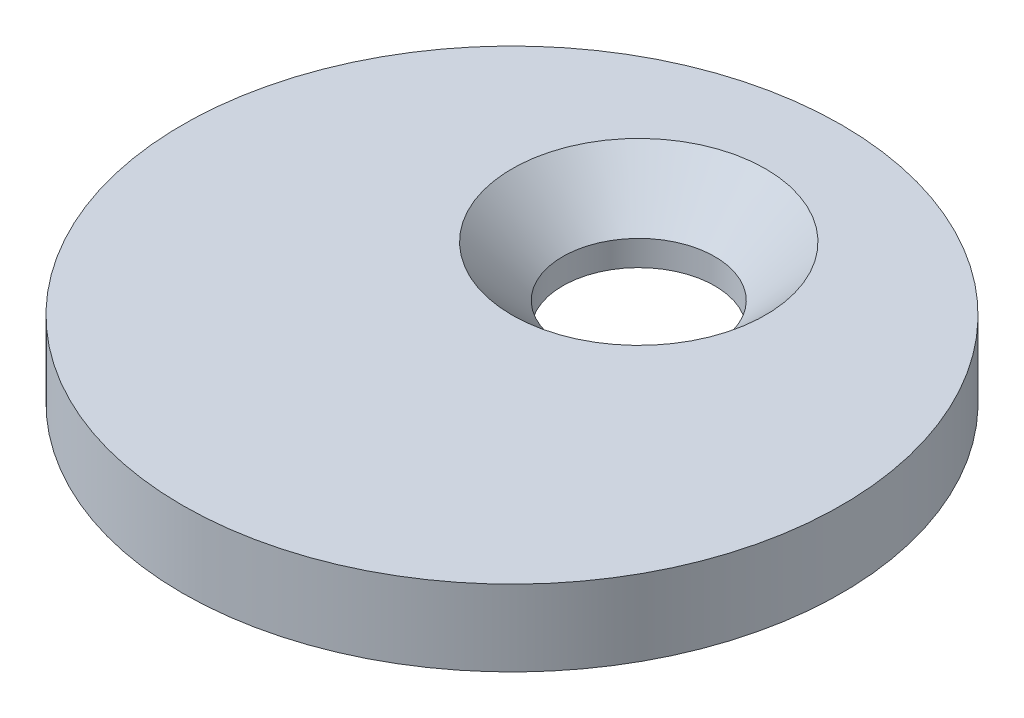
ISO-10303-21;
HEADER;
FILE_DESCRIPTION(('STEP AP214'),'2;1');
FILE_NAME('part.step','',(''),(''),'','','');
FILE_SCHEMA(('AUTOMOTIVE_DESIGN { 1 0 10303 214 1 1 1 1 }'));
ENDSEC;
DATA;
#1=APPLICATION_CONTEXT('core data for automotive mechanical design processes');
#2=APPLICATION_PROTOCOL_DEFINITION('international standard','automotive_design',2000,#1);
#3=PRODUCT_CONTEXT('',#1,'mechanical');
#4=PRODUCT('Part','Part','',(#3));
#5=PRODUCT_RELATED_PRODUCT_CATEGORY('part','',(#4));
#6=PRODUCT_DEFINITION_FORMATION('','',#4);
#7=PRODUCT_DEFINITION_CONTEXT('part definition',#1,'design');
#8=PRODUCT_DEFINITION('design','',#6,#7);
#9=PRODUCT_DEFINITION_SHAPE('','',#8);
#10=(LENGTH_UNIT() NAMED_UNIT(*) SI_UNIT(.MILLI.,.METRE.));
#11=(NAMED_UNIT(*) PLANE_ANGLE_UNIT() SI_UNIT($,.RADIAN.));
#12=(NAMED_UNIT(*) SI_UNIT($,.STERADIAN.) SOLID_ANGLE_UNIT());
#13=UNCERTAINTY_MEASURE_WITH_UNIT(LENGTH_MEASURE(1.E-05),#10,'distance_accuracy_value','');
#14=(GEOMETRIC_REPRESENTATION_CONTEXT(3) GLOBAL_UNCERTAINTY_ASSIGNED_CONTEXT((#13)) GLOBAL_UNIT_ASSIGNED_CONTEXT((#10,
#11,#12)) REPRESENTATION_CONTEXT('',''));
#15=CARTESIAN_POINT('',(0.,0.,0.));
#16=DIRECTION('',(0.,0.,1.));
#17=DIRECTION('',(1.,0.,0.));
#18=AXIS2_PLACEMENT_3D('',#15,#16,#17);
#19=CARTESIAN_POINT('',(0.,3.,-5.));
#20=DIRECTION('',(0.,-1.,0.));
#21=DIRECTION('',(0.,0.,-1.));
#22=AXIS2_PLACEMENT_3D('',#19,#20,#21);
#23=CYLINDRICAL_SURFACE('',#22,3.);
#24=CARTESIAN_POINT('',(0.,0.,-5.));
#25=DIRECTION('',(0.,1.,0.));
#26=DIRECTION('',(0.,0.,1.));
#27=AXIS2_PLACEMENT_3D('',#24,#25,#26);
#28=CIRCLE('',#27,3.);
#29=CARTESIAN_POINT('',(0.,0.,-2.));
#30=VERTEX_POINT('',#29);
#31=EDGE_CURVE('E40',#30,#30,#28,.T.);
#32=ORIENTED_EDGE('',*,*,#31,.F.);
#33=EDGE_LOOP('',(#32));
#34=FACE_BOUND('',#33,.T.);
#35=CARTESIAN_POINT('',(0.,0.999999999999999,-5.));
#36=DIRECTION('',(0.,1.,0.));
#37=DIRECTION('',(0.,0.,1.));
#38=AXIS2_PLACEMENT_3D('',#35,#36,#37);
#39=CIRCLE('',#38,3.);
#40=CARTESIAN_POINT('',(0.,0.999999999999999,-2.));
#41=VERTEX_POINT('',#40);
#42=EDGE_CURVE('E44',#41,#41,#39,.T.);
#43=ORIENTED_EDGE('',*,*,#42,.T.);
#44=EDGE_LOOP('',(#43));
#45=FACE_BOUND('',#44,.T.);
#46=ADVANCED_FACE('F29',(#34,#45),#23,.F.);
#47=CARTESIAN_POINT('',(0.,3.,0.));
#48=DIRECTION('',(0.,1.,0.));
#49=DIRECTION('',(0.,0.,1.));
#50=AXIS2_PLACEMENT_3D('',#47,#48,#49);
#51=PLANE('',#50);
#52=CARTESIAN_POINT('',(0.,3.,-5.));
#53=DIRECTION('',(0.,1.,0.));
#54=DIRECTION('',(0.,0.,1.));
#55=AXIS2_PLACEMENT_3D('',#52,#53,#54);
#56=CIRCLE('',#55,5.);
#57=CARTESIAN_POINT('',(0.,3.,0.));
#58=VERTEX_POINT('',#57);
#59=EDGE_CURVE('E47',#58,#58,#56,.T.);
#60=ORIENTED_EDGE('',*,*,#59,.F.);
#61=EDGE_LOOP('',(#60));
#62=FACE_BOUND('',#61,.T.);
#63=CARTESIAN_POINT('',(0.,3.,0.));
#64=DIRECTION('',(0.,1.,0.));
#65=DIRECTION('',(0.,0.,1.));
#66=AXIS2_PLACEMENT_3D('',#63,#64,#65);
#67=CIRCLE('',#66,13.);
#68=CARTESIAN_POINT('',(0.,3.,13.));
#69=VERTEX_POINT('',#68);
#70=EDGE_CURVE('E10',#69,#69,#67,.T.);
#71=ORIENTED_EDGE('',*,*,#70,.T.);
#72=EDGE_LOOP('',(#71));
#73=FACE_BOUND('',#72,.T.);
#74=ADVANCED_FACE('F53',(#62,#73),#51,.T.);
#75=CARTESIAN_POINT('',(0.,0.,0.));
#76=DIRECTION('',(0.,1.,0.));
#77=DIRECTION('',(0.,0.,1.));
#78=AXIS2_PLACEMENT_3D('',#75,#76,#77);
#79=PLANE('',#78);
#80=CARTESIAN_POINT('',(0.,0.,0.));
#81=DIRECTION('',(0.,1.,0.));
#82=DIRECTION('',(0.,0.,1.));
#83=AXIS2_PLACEMENT_3D('',#80,#81,#82);
#84=CIRCLE('',#83,13.);
#85=CARTESIAN_POINT('',(0.,0.,13.));
#86=VERTEX_POINT('',#85);
#87=EDGE_CURVE('E33',#86,#86,#84,.T.);
#88=ORIENTED_EDGE('',*,*,#87,.F.);
#89=EDGE_LOOP('',(#88));
#90=FACE_BOUND('',#89,.T.);
#91=ORIENTED_EDGE('',*,*,#31,.T.);
#92=EDGE_LOOP('',(#91));
#93=FACE_BOUND('',#92,.T.);
#94=ADVANCED_FACE('F55',(#90,#93),#79,.F.);
#95=CARTESIAN_POINT('',(0.,3.,0.));
#96=DIRECTION('',(0.,-1.,0.));
#97=DIRECTION('',(0.,0.,-1.));
#98=AXIS2_PLACEMENT_3D('',#95,#96,#97);
#99=CYLINDRICAL_SURFACE('',#98,13.);
#100=ORIENTED_EDGE('',*,*,#70,.F.);
#101=EDGE_LOOP('',(#100));
#102=FACE_BOUND('',#101,.T.);
#103=ORIENTED_EDGE('',*,*,#87,.T.);
#104=EDGE_LOOP('',(#103));
#105=FACE_BOUND('',#104,.T.);
#106=ADVANCED_FACE('F31',(#102,#105),#99,.T.);
#107=CARTESIAN_POINT('',(0.,3.,-5.));
#108=DIRECTION('',(0.,1.,0.));
#109=DIRECTION('',(0.,0.,1.));
#110=AXIS2_PLACEMENT_3D('',#107,#108,#109);
#111=CONICAL_SURFACE('',#110,5.,0.785398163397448);
#112=ORIENTED_EDGE('',*,*,#42,.F.);
#113=EDGE_LOOP('',(#112));
#114=FACE_BOUND('',#113,.T.);
#115=ORIENTED_EDGE('',*,*,#59,.T.);
#116=EDGE_LOOP('',(#115));
#117=FACE_BOUND('',#116,.T.);
#118=ADVANCED_FACE('F51',(#114,#117),#111,.F.);
#119=CLOSED_SHELL('',(#46,#74,#94,#106,#118));
#120=MANIFOLD_SOLID_BREP('B2',#119);
#121=ADVANCED_BREP_SHAPE_REPRESENTATION('',(#18,#120),#14);
#122=SHAPE_DEFINITION_REPRESENTATION(#9,#121);
ENDSEC;
END-ISO-10303-21;
